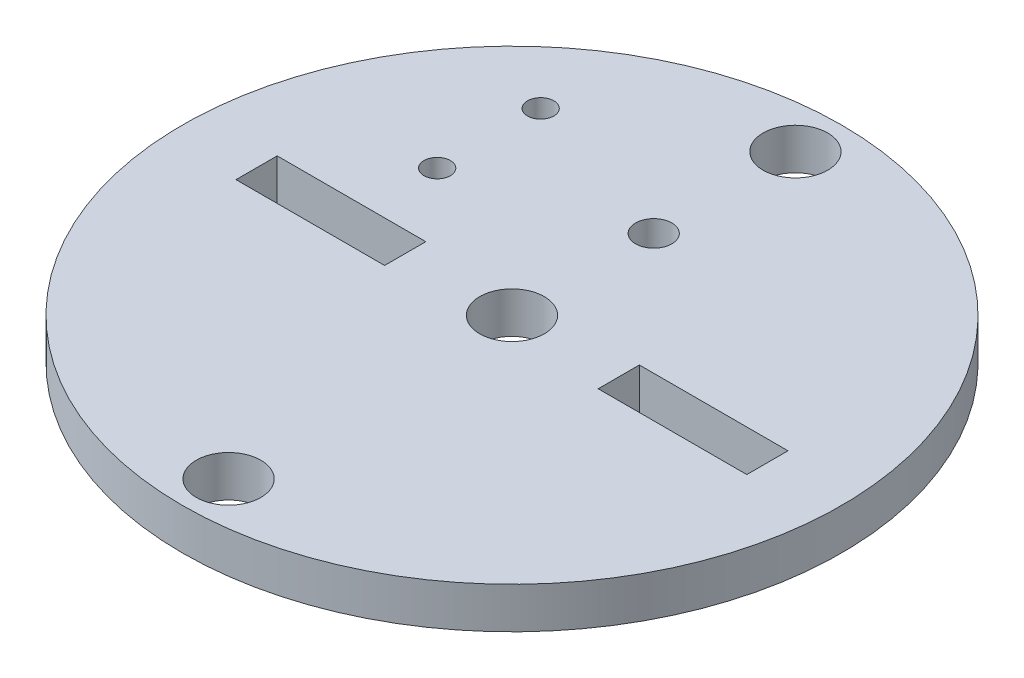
ISO-10303-21;
HEADER;
FILE_DESCRIPTION(('STEP AP214'),'2;1');
FILE_NAME('part.step','',(''),(''),'','','');
FILE_SCHEMA(('AUTOMOTIVE_DESIGN { 1 0 10303 214 1 1 1 1 }'));
ENDSEC;
DATA;
#1=APPLICATION_CONTEXT('core data for automotive mechanical design processes');
#2=APPLICATION_PROTOCOL_DEFINITION('international standard','automotive_design',2000,#1);
#3=PRODUCT_CONTEXT('',#1,'mechanical');
#4=PRODUCT('Part','Part','',(#3));
#5=PRODUCT_RELATED_PRODUCT_CATEGORY('part','',(#4));
#6=PRODUCT_DEFINITION_FORMATION('','',#4);
#7=PRODUCT_DEFINITION_CONTEXT('part definition',#1,'design');
#8=PRODUCT_DEFINITION('design','',#6,#7);
#9=PRODUCT_DEFINITION_SHAPE('','',#8);
#10=(LENGTH_UNIT() NAMED_UNIT(*) SI_UNIT(.MILLI.,.METRE.));
#11=(NAMED_UNIT(*) PLANE_ANGLE_UNIT() SI_UNIT($,.RADIAN.));
#12=(NAMED_UNIT(*) SI_UNIT($,.STERADIAN.) SOLID_ANGLE_UNIT());
#13=UNCERTAINTY_MEASURE_WITH_UNIT(LENGTH_MEASURE(1.E-05),#10,'distance_accuracy_value','');
#14=(GEOMETRIC_REPRESENTATION_CONTEXT(3) GLOBAL_UNCERTAINTY_ASSIGNED_CONTEXT((#13)) GLOBAL_UNIT_ASSIGNED_CONTEXT((#10,
#11,#12)) REPRESENTATION_CONTEXT('',''));
#15=CARTESIAN_POINT('',(0.,0.,0.));
#16=DIRECTION('',(0.,0.,1.));
#17=DIRECTION('',(1.,0.,0.));
#18=AXIS2_PLACEMENT_3D('',#15,#16,#17);
#19=CARTESIAN_POINT('',(0.,3.175,0.));
#20=DIRECTION('',(0.,-1.,0.));
#21=DIRECTION('',(0.,0.,-1.));
#22=AXIS2_PLACEMENT_3D('',#19,#20,#21);
#23=CYLINDRICAL_SURFACE('',#22,25.4);
#24=CARTESIAN_POINT('',(0.,3.175,0.));
#25=DIRECTION('',(0.,1.,0.));
#26=DIRECTION('',(0.,0.,1.));
#27=AXIS2_PLACEMENT_3D('',#24,#25,#26);
#28=CIRCLE('',#27,25.4);
#29=CARTESIAN_POINT('',(0.,3.175,25.4));
#30=VERTEX_POINT('',#29);
#31=EDGE_CURVE('E11',#30,#30,#28,.T.);
#32=ORIENTED_EDGE('',*,*,#31,.F.);
#33=EDGE_LOOP('',(#32));
#34=FACE_BOUND('',#33,.T.);
#35=CARTESIAN_POINT('',(0.,0.,0.));
#36=DIRECTION('',(0.,1.,0.));
#37=DIRECTION('',(0.,0.,1.));
#38=AXIS2_PLACEMENT_3D('',#35,#36,#37);
#39=CIRCLE('',#38,25.4);
#40=CARTESIAN_POINT('',(0.,0.,25.4));
#41=VERTEX_POINT('',#40);
#42=EDGE_CURVE('E44',#41,#41,#39,.T.);
#43=ORIENTED_EDGE('',*,*,#42,.T.);
#44=EDGE_LOOP('',(#43));
#45=FACE_BOUND('',#44,.T.);
#46=ADVANCED_FACE('F41',(#34,#45),#23,.T.);
#47=CARTESIAN_POINT('',(0.,3.175,0.));
#48=DIRECTION('',(0.,1.,0.));
#49=DIRECTION('',(0.,0.,1.));
#50=AXIS2_PLACEMENT_3D('',#47,#48,#49);
#51=PLANE('',#50);
#52=CARTESIAN_POINT('',(0.,3.175,-10.922));
#53=DIRECTION('',(0.,1.,0.));
#54=DIRECTION('',(0.,0.,1.));
#55=AXIS2_PLACEMENT_3D('',#52,#53,#54);
#56=CIRCLE('',#55,1.397);
#57=CARTESIAN_POINT('',(0.,3.175,-9.525));
#58=VERTEX_POINT('',#57);
#59=EDGE_CURVE('E424',#58,#58,#56,.T.);
#60=ORIENTED_EDGE('',*,*,#59,.F.);
#61=EDGE_LOOP('',(#60));
#62=FACE_BOUND('',#61,.T.);
#63=CARTESIAN_POINT('',(-12.7,3.175,-14.9098));
#64=DIRECTION('',(0.,1.,0.));
#65=DIRECTION('',(0.,0.,1.));
#66=AXIS2_PLACEMENT_3D('',#63,#64,#65);
#67=CIRCLE('',#66,1.016);
#68=CARTESIAN_POINT('',(-12.7,3.175,-13.8938));
#69=VERTEX_POINT('',#68);
#70=EDGE_CURVE('E432',#69,#69,#67,.T.);
#71=ORIENTED_EDGE('',*,*,#70,.F.);
#72=EDGE_LOOP('',(#71));
#73=FACE_BOUND('',#72,.T.);
#74=CARTESIAN_POINT('',(-12.7,3.175,-6.9342));
#75=DIRECTION('',(0.,1.,0.));
#76=DIRECTION('',(0.,0.,-1.));
#77=AXIS2_PLACEMENT_3D('',#74,#75,#76);
#78=CIRCLE('',#77,1.016);
#79=CARTESIAN_POINT('',(-12.7,3.175,-7.9502));
#80=VERTEX_POINT('',#79);
#81=EDGE_CURVE('E137',#80,#80,#78,.T.);
#82=ORIENTED_EDGE('',*,*,#81,.F.);
#83=EDGE_LOOP('',(#82));
#84=FACE_BOUND('',#83,.T.);
#85=DIRECTION('',(0.,0.,-1.));
#86=VECTOR('',#85,1.);
#87=CARTESIAN_POINT('',(19.685,3.175,-1.5875));
#88=LINE('',#87,#86);
#89=CARTESIAN_POINT('',(19.685,3.175,1.5875));
#90=VERTEX_POINT('',#89);
#91=CARTESIAN_POINT('',(19.685,3.175,-1.5875));
#92=VERTEX_POINT('',#91);
#93=EDGE_CURVE('E56',#90,#92,#88,.T.);
#94=ORIENTED_EDGE('',*,*,#93,.F.);
#95=DIRECTION('',(1.,0.,0.));
#96=VECTOR('',#95,1.);
#97=CARTESIAN_POINT('',(8.2296,3.175,1.5875));
#98=LINE('',#97,#96);
#99=CARTESIAN_POINT('',(8.2296,3.175,1.5875));
#100=VERTEX_POINT('',#99);
#101=EDGE_CURVE('E130',#100,#90,#98,.T.);
#102=ORIENTED_EDGE('',*,*,#101,.F.);
#103=DIRECTION('',(0.,0.,1.));
#104=VECTOR('',#103,1.);
#105=CARTESIAN_POINT('',(8.2296,3.175,-1.5875));
#106=LINE('',#105,#104);
#107=CARTESIAN_POINT('',(8.2296,3.175,-1.5875));
#108=VERTEX_POINT('',#107);
#109=EDGE_CURVE('E134',#108,#100,#106,.T.);
#110=ORIENTED_EDGE('',*,*,#109,.F.);
#111=DIRECTION('',(-1.,0.,0.));
#112=VECTOR('',#111,1.);
#113=CARTESIAN_POINT('',(8.2296,3.175,-1.5875));
#114=LINE('',#113,#112);
#115=EDGE_CURVE('E146',#92,#108,#114,.T.);
#116=ORIENTED_EDGE('',*,*,#115,.F.);
#117=EDGE_LOOP('',(#94,#102,#110,#116));
#118=FACE_BOUND('',#117,.T.);
#119=DIRECTION('',(0.,0.,-1.));
#120=VECTOR('',#119,1.);
#121=CARTESIAN_POINT('',(-8.2296,3.175,-1.5875));
#122=LINE('',#121,#120);
#123=CARTESIAN_POINT('',(-8.2296,3.175,1.5875));
#124=VERTEX_POINT('',#123);
#125=CARTESIAN_POINT('',(-8.2296,3.175,-1.5875));
#126=VERTEX_POINT('',#125);
#127=EDGE_CURVE('E64',#124,#126,#122,.T.);
#128=ORIENTED_EDGE('',*,*,#127,.F.);
#129=DIRECTION('',(1.,0.,0.));
#130=VECTOR('',#129,1.);
#131=CARTESIAN_POINT('',(-8.2296,3.175,1.5875));
#132=LINE('',#131,#130);
#133=CARTESIAN_POINT('',(-19.685,3.175,1.5875));
#134=VERTEX_POINT('',#133);
#135=EDGE_CURVE('E167',#134,#124,#132,.T.);
#136=ORIENTED_EDGE('',*,*,#135,.F.);
#137=DIRECTION('',(0.,0.,1.));
#138=VECTOR('',#137,1.);
#139=CARTESIAN_POINT('',(-19.685,3.175,-1.5875));
#140=LINE('',#139,#138);
#141=CARTESIAN_POINT('',(-19.685,3.175,-1.5875));
#142=VERTEX_POINT('',#141);
#143=EDGE_CURVE('E187',#142,#134,#140,.T.);
#144=ORIENTED_EDGE('',*,*,#143,.F.);
#145=DIRECTION('',(-1.,0.,0.));
#146=VECTOR('',#145,1.);
#147=CARTESIAN_POINT('',(-8.2296,3.175,-1.5875));
#148=LINE('',#147,#146);
#149=EDGE_CURVE('E182',#126,#142,#148,.T.);
#150=ORIENTED_EDGE('',*,*,#149,.F.);
#151=EDGE_LOOP('',(#128,#136,#144,#150));
#152=FACE_BOUND('',#151,.T.);
#153=CARTESIAN_POINT('',(0.,3.175,0.));
#154=DIRECTION('',(0.,1.,0.));
#155=DIRECTION('',(0.,0.,1.));
#156=AXIS2_PLACEMENT_3D('',#153,#154,#155);
#157=CIRCLE('',#156,2.4892);
#158=CARTESIAN_POINT('',(0.,3.175,2.4892));
#159=VERTEX_POINT('',#158);
#160=EDGE_CURVE('E156',#159,#159,#157,.T.);
#161=ORIENTED_EDGE('',*,*,#160,.F.);
#162=EDGE_LOOP('',(#161));
#163=FACE_BOUND('',#162,.T.);
#164=CARTESIAN_POINT('',(0.,3.175,-21.844));
#165=DIRECTION('',(0.,1.,0.));
#166=DIRECTION('',(0.,0.,1.));
#167=AXIS2_PLACEMENT_3D('',#164,#165,#166);
#168=CIRCLE('',#167,2.4892);
#169=CARTESIAN_POINT('',(0.,3.175,-19.3548));
#170=VERTEX_POINT('',#169);
#171=EDGE_CURVE('E211',#170,#170,#168,.T.);
#172=ORIENTED_EDGE('',*,*,#171,.F.);
#173=EDGE_LOOP('',(#172));
#174=FACE_BOUND('',#173,.T.);
#175=CARTESIAN_POINT('',(0.,3.175,21.844));
#176=DIRECTION('',(0.,1.,0.));
#177=DIRECTION('',(0.,0.,1.));
#178=AXIS2_PLACEMENT_3D('',#175,#176,#177);
#179=CIRCLE('',#178,2.4892);
#180=CARTESIAN_POINT('',(0.,3.175,24.3332));
#181=VERTEX_POINT('',#180);
#182=EDGE_CURVE('E219',#181,#181,#179,.T.);
#183=ORIENTED_EDGE('',*,*,#182,.F.);
#184=EDGE_LOOP('',(#183));
#185=FACE_BOUND('',#184,.T.);
#186=ORIENTED_EDGE('',*,*,#31,.T.);
#187=EDGE_LOOP('',(#186));
#188=FACE_BOUND('',#187,.T.);
#189=ADVANCED_FACE('F235',(#62,#73,#84,#118,#152,#163,#174,#185,#188),#51,.T.);
#190=CARTESIAN_POINT('',(0.,0.,0.));
#191=DIRECTION('',(0.,1.,0.));
#192=DIRECTION('',(0.,0.,1.));
#193=AXIS2_PLACEMENT_3D('',#190,#191,#192);
#194=PLANE('',#193);
#195=CARTESIAN_POINT('',(0.,0.,-10.922));
#196=DIRECTION('',(0.,1.,0.));
#197=DIRECTION('',(0.,0.,1.));
#198=AXIS2_PLACEMENT_3D('',#195,#196,#197);
#199=CIRCLE('',#198,1.397);
#200=CARTESIAN_POINT('',(0.,0.,-9.525));
#201=VERTEX_POINT('',#200);
#202=EDGE_CURVE('E183',#201,#201,#199,.T.);
#203=ORIENTED_EDGE('',*,*,#202,.T.);
#204=EDGE_LOOP('',(#203));
#205=FACE_BOUND('',#204,.T.);
#206=CARTESIAN_POINT('',(-12.7,0.,-14.9098));
#207=DIRECTION('',(0.,1.,0.));
#208=DIRECTION('',(0.,0.,1.));
#209=AXIS2_PLACEMENT_3D('',#206,#207,#208);
#210=CIRCLE('',#209,1.016);
#211=CARTESIAN_POINT('',(-12.7,0.,-13.8938));
#212=VERTEX_POINT('',#211);
#213=EDGE_CURVE('E426',#212,#212,#210,.T.);
#214=ORIENTED_EDGE('',*,*,#213,.T.);
#215=EDGE_LOOP('',(#214));
#216=FACE_BOUND('',#215,.T.);
#217=CARTESIAN_POINT('',(-12.7,0.,-6.9342));
#218=DIRECTION('',(0.,1.,0.));
#219=DIRECTION('',(0.,0.,-1.));
#220=AXIS2_PLACEMENT_3D('',#217,#218,#219);
#221=CIRCLE('',#220,1.016);
#222=CARTESIAN_POINT('',(-12.7,0.,-7.9502));
#223=VERTEX_POINT('',#222);
#224=EDGE_CURVE('E437',#223,#223,#221,.T.);
#225=ORIENTED_EDGE('',*,*,#224,.T.);
#226=EDGE_LOOP('',(#225));
#227=FACE_BOUND('',#226,.T.);
#228=DIRECTION('',(1.,0.,0.));
#229=VECTOR('',#228,1.);
#230=CARTESIAN_POINT('',(8.2296,0.,1.5875));
#231=LINE('',#230,#229);
#232=CARTESIAN_POINT('',(8.2296,0.,1.5875));
#233=VERTEX_POINT('',#232);
#234=CARTESIAN_POINT('',(19.685,0.,1.5875));
#235=VERTEX_POINT('',#234);
#236=EDGE_CURVE('E115',#233,#235,#231,.T.);
#237=ORIENTED_EDGE('',*,*,#236,.T.);
#238=DIRECTION('',(0.,0.,-1.));
#239=VECTOR('',#238,1.);
#240=CARTESIAN_POINT('',(19.685,0.,-1.5875));
#241=LINE('',#240,#239);
#242=CARTESIAN_POINT('',(19.685,0.,-1.5875));
#243=VERTEX_POINT('',#242);
#244=EDGE_CURVE('E108',#235,#243,#241,.T.);
#245=ORIENTED_EDGE('',*,*,#244,.T.);
#246=DIRECTION('',(-1.,0.,0.));
#247=VECTOR('',#246,1.);
#248=CARTESIAN_POINT('',(8.2296,0.,-1.5875));
#249=LINE('',#248,#247);
#250=CARTESIAN_POINT('',(8.2296,0.,-1.5875));
#251=VERTEX_POINT('',#250);
#252=EDGE_CURVE('E119',#243,#251,#249,.T.);
#253=ORIENTED_EDGE('',*,*,#252,.T.);
#254=DIRECTION('',(0.,0.,1.));
#255=VECTOR('',#254,1.);
#256=CARTESIAN_POINT('',(8.2296,0.,-1.5875));
#257=LINE('',#256,#255);
#258=EDGE_CURVE('E124',#251,#233,#257,.T.);
#259=ORIENTED_EDGE('',*,*,#258,.T.);
#260=EDGE_LOOP('',(#237,#245,#253,#259));
#261=FACE_BOUND('',#260,.T.);
#262=DIRECTION('',(1.,0.,0.));
#263=VECTOR('',#262,1.);
#264=CARTESIAN_POINT('',(-8.2296,0.,1.5875));
#265=LINE('',#264,#263);
#266=CARTESIAN_POINT('',(-19.685,0.,1.5875));
#267=VERTEX_POINT('',#266);
#268=CARTESIAN_POINT('',(-8.2296,0.,1.5875));
#269=VERTEX_POINT('',#268);
#270=EDGE_CURVE('E175',#267,#269,#265,.T.);
#271=ORIENTED_EDGE('',*,*,#270,.T.);
#272=DIRECTION('',(0.,0.,-1.));
#273=VECTOR('',#272,1.);
#274=CARTESIAN_POINT('',(-8.2296,0.,-1.5875));
#275=LINE('',#274,#273);
#276=CARTESIAN_POINT('',(-8.2296,0.,-1.5875));
#277=VERTEX_POINT('',#276);
#278=EDGE_CURVE('E162',#269,#277,#275,.T.);
#279=ORIENTED_EDGE('',*,*,#278,.T.);
#280=DIRECTION('',(-1.,0.,0.));
#281=VECTOR('',#280,1.);
#282=CARTESIAN_POINT('',(-8.2296,0.,-1.5875));
#283=LINE('',#282,#281);
#284=CARTESIAN_POINT('',(-19.685,0.,-1.5875));
#285=VERTEX_POINT('',#284);
#286=EDGE_CURVE('E166',#277,#285,#283,.T.);
#287=ORIENTED_EDGE('',*,*,#286,.T.);
#288=DIRECTION('',(0.,0.,1.));
#289=VECTOR('',#288,1.);
#290=CARTESIAN_POINT('',(-19.685,0.,-1.5875));
#291=LINE('',#290,#289);
#292=EDGE_CURVE('E171',#285,#267,#291,.T.);
#293=ORIENTED_EDGE('',*,*,#292,.T.);
#294=EDGE_LOOP('',(#271,#279,#287,#293));
#295=FACE_BOUND('',#294,.T.);
#296=CARTESIAN_POINT('',(0.,0.,0.));
#297=DIRECTION('',(0.,1.,0.));
#298=DIRECTION('',(0.,0.,1.));
#299=AXIS2_PLACEMENT_3D('',#296,#297,#298);
#300=CIRCLE('',#299,2.4892);
#301=CARTESIAN_POINT('',(0.,0.,2.4892));
#302=VERTEX_POINT('',#301);
#303=EDGE_CURVE('E207',#302,#302,#300,.T.);
#304=ORIENTED_EDGE('',*,*,#303,.T.);
#305=EDGE_LOOP('',(#304));
#306=FACE_BOUND('',#305,.T.);
#307=CARTESIAN_POINT('',(0.,0.,-21.844));
#308=DIRECTION('',(0.,1.,0.));
#309=DIRECTION('',(0.,0.,1.));
#310=AXIS2_PLACEMENT_3D('',#307,#308,#309);
#311=CIRCLE('',#310,2.4892);
#312=CARTESIAN_POINT('',(0.,0.,-19.3548));
#313=VERTEX_POINT('',#312);
#314=EDGE_CURVE('E215',#313,#313,#311,.T.);
#315=ORIENTED_EDGE('',*,*,#314,.T.);
#316=EDGE_LOOP('',(#315));
#317=FACE_BOUND('',#316,.T.);
#318=CARTESIAN_POINT('',(0.,0.,21.844));
#319=DIRECTION('',(0.,1.,0.));
#320=DIRECTION('',(0.,0.,1.));
#321=AXIS2_PLACEMENT_3D('',#318,#319,#320);
#322=CIRCLE('',#321,2.4892);
#323=CARTESIAN_POINT('',(0.,0.,24.3332));
#324=VERTEX_POINT('',#323);
#325=EDGE_CURVE('E223',#324,#324,#322,.T.);
#326=ORIENTED_EDGE('',*,*,#325,.T.);
#327=EDGE_LOOP('',(#326));
#328=FACE_BOUND('',#327,.T.);
#329=ORIENTED_EDGE('',*,*,#42,.F.);
#330=EDGE_LOOP('',(#329));
#331=FACE_BOUND('',#330,.T.);
#332=ADVANCED_FACE('F126',(#205,#216,#227,#261,#295,#306,#317,#328,#331),#194,.F.);
#333=CARTESIAN_POINT('',(0.,3.175,21.844));
#334=DIRECTION('',(0.,1.,0.));
#335=DIRECTION('',(0.,0.,1.));
#336=AXIS2_PLACEMENT_3D('',#333,#334,#335);
#337=CYLINDRICAL_SURFACE('',#336,2.4892);
#338=ORIENTED_EDGE('',*,*,#325,.F.);
#339=EDGE_LOOP('',(#338));
#340=FACE_BOUND('',#339,.T.);
#341=ORIENTED_EDGE('',*,*,#182,.T.);
#342=EDGE_LOOP('',(#341));
#343=FACE_BOUND('',#342,.T.);
#344=ADVANCED_FACE('F234',(#340,#343),#337,.F.);
#345=CARTESIAN_POINT('',(0.,3.175,-21.844));
#346=DIRECTION('',(0.,1.,0.));
#347=DIRECTION('',(0.,0.,1.));
#348=AXIS2_PLACEMENT_3D('',#345,#346,#347);
#349=CYLINDRICAL_SURFACE('',#348,2.4892);
#350=ORIENTED_EDGE('',*,*,#314,.F.);
#351=EDGE_LOOP('',(#350));
#352=FACE_BOUND('',#351,.T.);
#353=ORIENTED_EDGE('',*,*,#171,.T.);
#354=EDGE_LOOP('',(#353));
#355=FACE_BOUND('',#354,.T.);
#356=ADVANCED_FACE('F241',(#352,#355),#349,.F.);
#357=CARTESIAN_POINT('',(0.,3.175,0.));
#358=DIRECTION('',(0.,1.,0.));
#359=DIRECTION('',(0.,0.,1.));
#360=AXIS2_PLACEMENT_3D('',#357,#358,#359);
#361=CYLINDRICAL_SURFACE('',#360,2.4892);
#362=ORIENTED_EDGE('',*,*,#303,.F.);
#363=EDGE_LOOP('',(#362));
#364=FACE_BOUND('',#363,.T.);
#365=ORIENTED_EDGE('',*,*,#160,.T.);
#366=EDGE_LOOP('',(#365));
#367=FACE_BOUND('',#366,.T.);
#368=ADVANCED_FACE('F332',(#364,#367),#361,.F.);
#369=CARTESIAN_POINT('',(-8.2296,0.,-1.5875));
#370=DIRECTION('',(1.,0.,0.));
#371=DIRECTION('',(0.,0.,-1.));
#372=AXIS2_PLACEMENT_3D('',#369,#370,#371);
#373=PLANE('',#372);
#374=ORIENTED_EDGE('',*,*,#127,.T.);
#375=DIRECTION('',(0.,1.,0.));
#376=VECTOR('',#375,1.);
#377=CARTESIAN_POINT('',(-8.2296,0.,-1.5875));
#378=LINE('',#377,#376);
#379=EDGE_CURVE('E179',#277,#126,#378,.T.);
#380=ORIENTED_EDGE('',*,*,#379,.F.);
#381=ORIENTED_EDGE('',*,*,#278,.F.);
#382=DIRECTION('',(0.,1.,0.));
#383=VECTOR('',#382,1.);
#384=CARTESIAN_POINT('',(-8.2296,0.,1.5875));
#385=LINE('',#384,#383);
#386=EDGE_CURVE('E147',#269,#124,#385,.T.);
#387=ORIENTED_EDGE('',*,*,#386,.T.);
#388=EDGE_LOOP('',(#374,#380,#381,#387));
#389=FACE_BOUND('',#388,.T.);
#390=ADVANCED_FACE('F322',(#389),#373,.F.);
#391=CARTESIAN_POINT('',(-8.2296,0.,1.5875));
#392=DIRECTION('',(0.,0.,1.));
#393=DIRECTION('',(1.,0.,0.));
#394=AXIS2_PLACEMENT_3D('',#391,#392,#393);
#395=PLANE('',#394);
#396=ORIENTED_EDGE('',*,*,#135,.T.);
#397=ORIENTED_EDGE('',*,*,#386,.F.);
#398=ORIENTED_EDGE('',*,*,#270,.F.);
#399=DIRECTION('',(0.,1.,0.));
#400=VECTOR('',#399,1.);
#401=CARTESIAN_POINT('',(-19.685,0.,1.5875));
#402=LINE('',#401,#400);
#403=EDGE_CURVE('E196',#267,#134,#402,.T.);
#404=ORIENTED_EDGE('',*,*,#403,.T.);
#405=EDGE_LOOP('',(#396,#397,#398,#404));
#406=FACE_BOUND('',#405,.T.);
#407=ADVANCED_FACE('F318',(#406),#395,.F.);
#408=CARTESIAN_POINT('',(-19.685,0.,-1.5875));
#409=DIRECTION('',(-1.,0.,0.));
#410=DIRECTION('',(0.,0.,1.));
#411=AXIS2_PLACEMENT_3D('',#408,#409,#410);
#412=PLANE('',#411);
#413=ORIENTED_EDGE('',*,*,#143,.T.);
#414=ORIENTED_EDGE('',*,*,#403,.F.);
#415=ORIENTED_EDGE('',*,*,#292,.F.);
#416=DIRECTION('',(0.,1.,0.));
#417=VECTOR('',#416,1.);
#418=CARTESIAN_POINT('',(-19.685,0.,-1.5875));
#419=LINE('',#418,#417);
#420=EDGE_CURVE('E199',#285,#142,#419,.T.);
#421=ORIENTED_EDGE('',*,*,#420,.T.);
#422=EDGE_LOOP('',(#413,#414,#415,#421));
#423=FACE_BOUND('',#422,.T.);
#424=ADVANCED_FACE('F321',(#423),#412,.F.);
#425=CARTESIAN_POINT('',(-8.2296,0.,-1.5875));
#426=DIRECTION('',(0.,0.,-1.));
#427=DIRECTION('',(-1.,0.,0.));
#428=AXIS2_PLACEMENT_3D('',#425,#426,#427);
#429=PLANE('',#428);
#430=ORIENTED_EDGE('',*,*,#149,.T.);
#431=ORIENTED_EDGE('',*,*,#420,.F.);
#432=ORIENTED_EDGE('',*,*,#286,.F.);
#433=ORIENTED_EDGE('',*,*,#379,.T.);
#434=EDGE_LOOP('',(#430,#431,#432,#433));
#435=FACE_BOUND('',#434,.T.);
#436=ADVANCED_FACE('F317',(#435),#429,.F.);
#437=CARTESIAN_POINT('',(19.685,0.,-1.5875));
#438=DIRECTION('',(1.,0.,0.));
#439=DIRECTION('',(0.,0.,-1.));
#440=AXIS2_PLACEMENT_3D('',#437,#438,#439);
#441=PLANE('',#440);
#442=ORIENTED_EDGE('',*,*,#93,.T.);
#443=DIRECTION('',(0.,1.,0.));
#444=VECTOR('',#443,1.);
#445=CARTESIAN_POINT('',(19.685,0.,-1.5875));
#446=LINE('',#445,#444);
#447=EDGE_CURVE('E104',#243,#92,#446,.T.);
#448=ORIENTED_EDGE('',*,*,#447,.F.);
#449=ORIENTED_EDGE('',*,*,#244,.F.);
#450=DIRECTION('',(0.,1.,0.));
#451=VECTOR('',#450,1.);
#452=CARTESIAN_POINT('',(19.685,0.,1.5875));
#453=LINE('',#452,#451);
#454=EDGE_CURVE('E153',#235,#90,#453,.T.);
#455=ORIENTED_EDGE('',*,*,#454,.T.);
#456=EDGE_LOOP('',(#442,#448,#449,#455));
#457=FACE_BOUND('',#456,.T.);
#458=ADVANCED_FACE('F106',(#457),#441,.F.);
#459=CARTESIAN_POINT('',(8.2296,0.,1.5875));
#460=DIRECTION('',(0.,0.,1.));
#461=DIRECTION('',(1.,0.,0.));
#462=AXIS2_PLACEMENT_3D('',#459,#460,#461);
#463=PLANE('',#462);
#464=ORIENTED_EDGE('',*,*,#101,.T.);
#465=ORIENTED_EDGE('',*,*,#454,.F.);
#466=ORIENTED_EDGE('',*,*,#236,.F.);
#467=DIRECTION('',(0.,1.,0.));
#468=VECTOR('',#467,1.);
#469=CARTESIAN_POINT('',(8.2296,0.,1.5875));
#470=LINE('',#469,#468);
#471=EDGE_CURVE('E157',#233,#100,#470,.T.);
#472=ORIENTED_EDGE('',*,*,#471,.T.);
#473=EDGE_LOOP('',(#464,#465,#466,#472));
#474=FACE_BOUND('',#473,.T.);
#475=ADVANCED_FACE('F306',(#474),#463,.F.);
#476=CARTESIAN_POINT('',(8.2296,0.,-1.5875));
#477=DIRECTION('',(-1.,0.,0.));
#478=DIRECTION('',(0.,0.,1.));
#479=AXIS2_PLACEMENT_3D('',#476,#477,#478);
#480=PLANE('',#479);
#481=ORIENTED_EDGE('',*,*,#109,.T.);
#482=ORIENTED_EDGE('',*,*,#471,.F.);
#483=ORIENTED_EDGE('',*,*,#258,.F.);
#484=DIRECTION('',(0.,1.,0.));
#485=VECTOR('',#484,1.);
#486=CARTESIAN_POINT('',(8.2296,0.,-1.5875));
#487=LINE('',#486,#485);
#488=EDGE_CURVE('E114',#251,#108,#487,.T.);
#489=ORIENTED_EDGE('',*,*,#488,.T.);
#490=EDGE_LOOP('',(#481,#482,#483,#489));
#491=FACE_BOUND('',#490,.T.);
#492=ADVANCED_FACE('F309',(#491),#480,.F.);
#493=CARTESIAN_POINT('',(8.2296,0.,-1.5875));
#494=DIRECTION('',(0.,0.,-1.));
#495=DIRECTION('',(-1.,0.,0.));
#496=AXIS2_PLACEMENT_3D('',#493,#494,#495);
#497=PLANE('',#496);
#498=ORIENTED_EDGE('',*,*,#115,.T.);
#499=ORIENTED_EDGE('',*,*,#488,.F.);
#500=ORIENTED_EDGE('',*,*,#252,.F.);
#501=ORIENTED_EDGE('',*,*,#447,.T.);
#502=EDGE_LOOP('',(#498,#499,#500,#501));
#503=FACE_BOUND('',#502,.T.);
#504=ADVANCED_FACE('F120',(#503),#497,.F.);
#505=CARTESIAN_POINT('',(-12.7,0.,-6.9342));
#506=DIRECTION('',(0.,1.,0.));
#507=DIRECTION('',(0.,0.,1.));
#508=AXIS2_PLACEMENT_3D('',#505,#506,#507);
#509=CYLINDRICAL_SURFACE('',#508,1.016);
#510=ORIENTED_EDGE('',*,*,#224,.F.);
#511=EDGE_LOOP('',(#510));
#512=FACE_BOUND('',#511,.T.);
#513=ORIENTED_EDGE('',*,*,#81,.T.);
#514=EDGE_LOOP('',(#513));
#515=FACE_BOUND('',#514,.T.);
#516=ADVANCED_FACE('F274',(#512,#515),#509,.F.);
#517=CARTESIAN_POINT('',(-12.7,0.,-14.9098));
#518=DIRECTION('',(0.,1.,0.));
#519=DIRECTION('',(0.,0.,1.));
#520=AXIS2_PLACEMENT_3D('',#517,#518,#519);
#521=CYLINDRICAL_SURFACE('',#520,1.016);
#522=ORIENTED_EDGE('',*,*,#213,.F.);
#523=EDGE_LOOP('',(#522));
#524=FACE_BOUND('',#523,.T.);
#525=ORIENTED_EDGE('',*,*,#70,.T.);
#526=EDGE_LOOP('',(#525));
#527=FACE_BOUND('',#526,.T.);
#528=ADVANCED_FACE('F279',(#524,#527),#521,.F.);
#529=CARTESIAN_POINT('',(0.,0.,-10.922));
#530=DIRECTION('',(0.,1.,0.));
#531=DIRECTION('',(0.,0.,1.));
#532=AXIS2_PLACEMENT_3D('',#529,#530,#531);
#533=CYLINDRICAL_SURFACE('',#532,1.397);
#534=ORIENTED_EDGE('',*,*,#202,.F.);
#535=EDGE_LOOP('',(#534));
#536=FACE_BOUND('',#535,.T.);
#537=ORIENTED_EDGE('',*,*,#59,.T.);
#538=EDGE_LOOP('',(#537));
#539=FACE_BOUND('',#538,.T.);
#540=ADVANCED_FACE('F289',(#536,#539),#533,.F.);
#541=CLOSED_SHELL('',(#46,#189,#332,#344,#356,#368,#390,#407,#424,#436,#458,#475,#492,#504,#516,
#528,#540));
#542=MANIFOLD_SOLID_BREP('B2',#541);
#543=ADVANCED_BREP_SHAPE_REPRESENTATION('',(#18,#542),#14);
#544=SHAPE_DEFINITION_REPRESENTATION(#9,#543);
ENDSEC;
END-ISO-10303-21;
